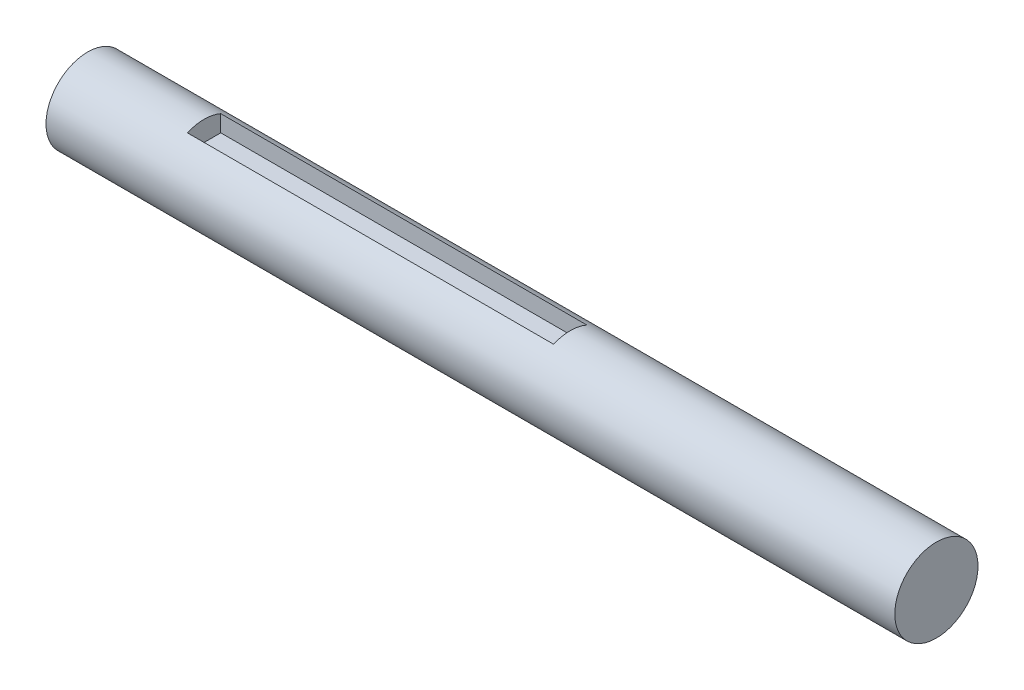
from build123d import *
from build123d.topology import SkipClean

# Parameters (mm, degrees)
BOSS_EXTRUDE1_DEPTH      = 11
BOSS_EXTRUDE1_DEPTH_BACK = 11
SKETCH1_R                = 2.5
CUT_EXTRUDE1_DEPTH       = 22
SKETCH4_R                = 2.5
BOSS_EXTRUDE2_DEPTH      = 22
BOSS_EXTRUDE3_START      = 7
SKETCH5_R                = 2.5
BOSS_EXTRUDE3_DEPTH      = 7


with BuildPart() as part:
    # Sketch1 → Boss-Extrude1 (new, two sides: drawn at the far end of the back side and taken through both)
    with BuildSketch(Plane(origin=(0, 0, 0), x_dir=(0, 0, -1), z_dir=(1, 0, 0)).offset(-BOSS_EXTRUDE1_DEPTH_BACK)):
        Circle(SKETCH1_R)
    extrude(amount=BOSS_EXTRUDE1_DEPTH + BOSS_EXTRUDE1_DEPTH_BACK)

    # Sketch2 → Cut-Extrude1 (cut)
    with BuildSketch(Plane(origin=(11, 0, 0), x_dir=(0, 0, -1), z_dir=(1, 0, 0))):
        Polygon((-1, 2.291287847), (-1, 1.291287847), (1, 1.291287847), (1, 2.291287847), (1, 2.791287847), (-1, 2.791287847), align=None)
    extrude(amount=-CUT_EXTRUDE1_DEPTH, mode=Mode.SUBTRACT)

    # Sketch4 → Boss-Extrude2 (add)
    with BuildSketch(Plane(origin=(11, 0, 0), x_dir=(0, 0, -1), z_dir=(1, 0, 0))):
        Circle(SKETCH4_R)
    extrude(amount=BOSS_EXTRUDE2_DEPTH)

    # Sketch5 → Boss-Extrude3 (add)
    with SkipClean():  # the faces are left unmerged after this step: merging them gives an invalid solid
        with BuildSketch(Plane.ZY.offset(11).offset(BOSS_EXTRUDE3_START)):
            with Locations(Location((0, 0, 0), (0, 0, 180))):
                Circle(SKETCH5_R)
        extrude(amount=-BOSS_EXTRUDE3_DEPTH)


solid = part.part
